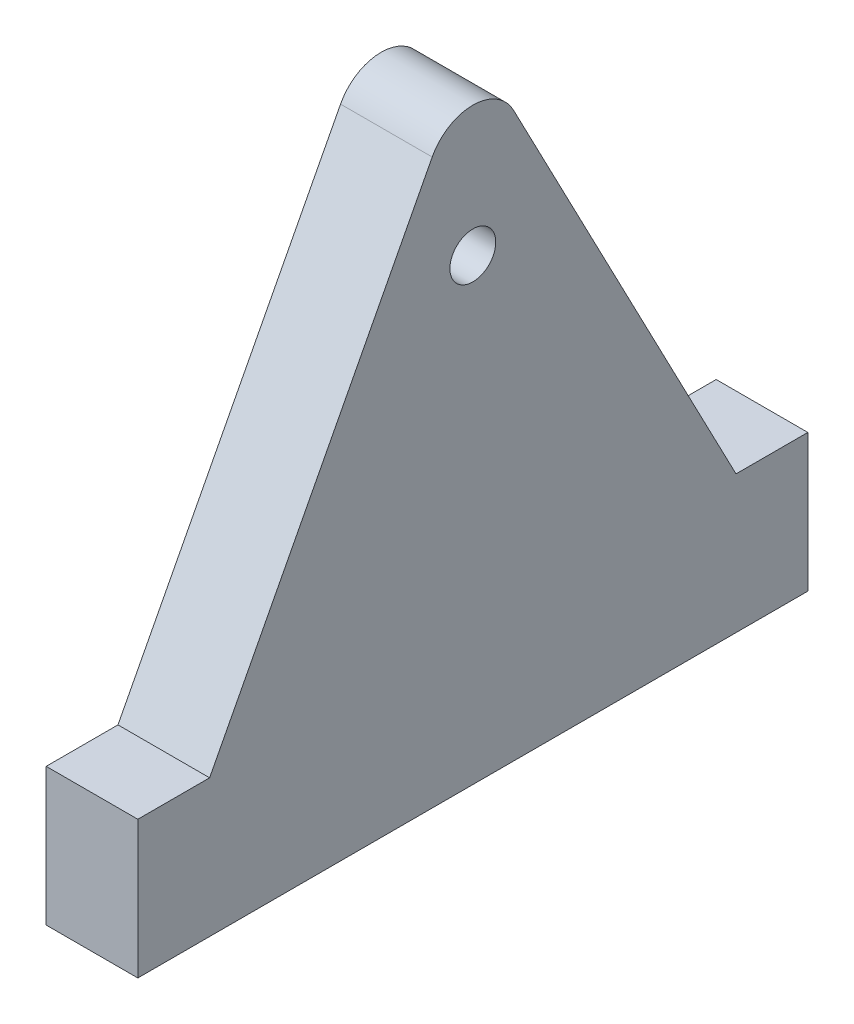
ISO-10303-21;
HEADER;
FILE_DESCRIPTION(('STEP AP214'),'2;1');
FILE_NAME('part.step','',(''),(''),'','','');
FILE_SCHEMA(('AUTOMOTIVE_DESIGN { 1 0 10303 214 1 1 1 1 }'));
ENDSEC;
DATA;
#1=APPLICATION_CONTEXT('core data for automotive mechanical design processes');
#2=APPLICATION_PROTOCOL_DEFINITION('international standard','automotive_design',2000,#1);
#3=PRODUCT_CONTEXT('',#1,'mechanical');
#4=PRODUCT('Part','Part','',(#3));
#5=PRODUCT_RELATED_PRODUCT_CATEGORY('part','',(#4));
#6=PRODUCT_DEFINITION_FORMATION('','',#4);
#7=PRODUCT_DEFINITION_CONTEXT('part definition',#1,'design');
#8=PRODUCT_DEFINITION('design','',#6,#7);
#9=PRODUCT_DEFINITION_SHAPE('','',#8);
#10=(LENGTH_UNIT() NAMED_UNIT(*) SI_UNIT(.MILLI.,.METRE.));
#11=(NAMED_UNIT(*) PLANE_ANGLE_UNIT() SI_UNIT($,.RADIAN.));
#12=(NAMED_UNIT(*) SI_UNIT($,.STERADIAN.) SOLID_ANGLE_UNIT());
#13=UNCERTAINTY_MEASURE_WITH_UNIT(LENGTH_MEASURE(1.E-05),#10,'distance_accuracy_value','');
#14=(GEOMETRIC_REPRESENTATION_CONTEXT(3) GLOBAL_UNCERTAINTY_ASSIGNED_CONTEXT((#13)) GLOBAL_UNIT_ASSIGNED_CONTEXT((#10,
#11,#12)) REPRESENTATION_CONTEXT('',''));
#15=CARTESIAN_POINT('',(0.,0.,0.));
#16=DIRECTION('',(0.,0.,1.));
#17=DIRECTION('',(1.,0.,0.));
#18=AXIS2_PLACEMENT_3D('',#15,#16,#17);
#19=CARTESIAN_POINT('',(20.,53.0229705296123,8.86438992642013));
#20=DIRECTION('',(0.,-0.462845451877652,-0.886438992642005));
#21=DIRECTION('',(0.,0.886438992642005,-0.462845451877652));
#22=AXIS2_PLACEMENT_3D('',#19,#20,#21);
#23=PLANE('',#22);
#24=DIRECTION('',(-1.,0.,0.));
#25=VECTOR('',#24,1.);
#26=CARTESIAN_POINT('',(20.,-40.,57.4354243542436));
#27=LINE('',#26,#25);
#28=CARTESIAN_POINT('',(20.,-40.,57.4354243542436));
#29=VERTEX_POINT('',#28);
#30=CARTESIAN_POINT('',(0.,-40.,57.4354243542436));
#31=VERTEX_POINT('',#30);
#32=EDGE_CURVE('E145',#29,#31,#27,.T.);
#33=ORIENTED_EDGE('',*,*,#32,.F.);
#34=DIRECTION('',(0.,-0.886438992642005,0.462845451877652));
#35=VECTOR('',#34,1.);
#36=CARTESIAN_POINT('',(20.,53.0229705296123,8.86438992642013));
#37=LINE('',#36,#35);
#38=CARTESIAN_POINT('',(20.,53.0229705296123,8.86438992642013));
#39=VERTEX_POINT('',#38);
#40=EDGE_CURVE('E157',#39,#29,#37,.T.);
#41=ORIENTED_EDGE('',*,*,#40,.F.);
#42=DIRECTION('',(-1.,0.,0.));
#43=VECTOR('',#42,1.);
#44=CARTESIAN_POINT('',(20.,53.0229705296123,8.86438992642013));
#45=LINE('',#44,#43);
#46=CARTESIAN_POINT('',(0.,53.0229705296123,8.86438992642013));
#47=VERTEX_POINT('',#46);
#48=EDGE_CURVE('E11',#39,#47,#45,.T.);
#49=ORIENTED_EDGE('',*,*,#48,.T.);
#50=DIRECTION('',(0.,-0.886438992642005,0.462845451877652));
#51=VECTOR('',#50,1.);
#52=CARTESIAN_POINT('',(0.,53.0229705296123,8.86438992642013));
#53=LINE('',#52,#51);
#54=EDGE_CURVE('E166',#47,#31,#53,.T.);
#55=ORIENTED_EDGE('',*,*,#54,.T.);
#56=EDGE_LOOP('',(#33,#41,#49,#55));
#57=FACE_BOUND('',#56,.T.);
#58=ADVANCED_FACE('F41',(#57),#23,.F.);
#59=CARTESIAN_POINT('',(20.,53.0229705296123,-8.86438992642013));
#60=DIRECTION('',(0.,0.462845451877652,-0.886438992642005));
#61=DIRECTION('',(0.,0.886438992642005,0.462845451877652));
#62=AXIS2_PLACEMENT_3D('',#59,#60,#61);
#63=PLANE('',#62);
#64=DIRECTION('',(0.,-0.886438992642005,-0.462845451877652));
#65=VECTOR('',#64,1.);
#66=CARTESIAN_POINT('',(20.,53.0229705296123,-8.86438992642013));
#67=LINE('',#66,#65);
#68=CARTESIAN_POINT('',(20.,53.0229705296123,-8.86438992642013));
#69=VERTEX_POINT('',#68);
#70=CARTESIAN_POINT('',(20.,-40.,-57.4354243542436));
#71=VERTEX_POINT('',#70);
#72=EDGE_CURVE('E56',#69,#71,#67,.T.);
#73=ORIENTED_EDGE('',*,*,#72,.T.);
#74=DIRECTION('',(-1.,0.,0.));
#75=VECTOR('',#74,1.);
#76=CARTESIAN_POINT('',(20.,-40.,-57.4354243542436));
#77=LINE('',#76,#75);
#78=CARTESIAN_POINT('',(0.,-40.,-57.4354243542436));
#79=VERTEX_POINT('',#78);
#80=EDGE_CURVE('E60',#71,#79,#77,.T.);
#81=ORIENTED_EDGE('',*,*,#80,.T.);
#82=DIRECTION('',(0.,-0.886438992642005,-0.462845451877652));
#83=VECTOR('',#82,1.);
#84=CARTESIAN_POINT('',(0.,53.0229705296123,-8.86438992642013));
#85=LINE('',#84,#83);
#86=CARTESIAN_POINT('',(0.,53.0229705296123,-8.86438992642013));
#87=VERTEX_POINT('',#86);
#88=EDGE_CURVE('E113',#87,#79,#85,.T.);
#89=ORIENTED_EDGE('',*,*,#88,.F.);
#90=DIRECTION('',(-1.,0.,0.));
#91=VECTOR('',#90,1.);
#92=CARTESIAN_POINT('',(20.,53.0229705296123,-8.86438992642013));
#93=LINE('',#92,#91);
#94=EDGE_CURVE('E163',#69,#87,#93,.T.);
#95=ORIENTED_EDGE('',*,*,#94,.F.);
#96=EDGE_LOOP('',(#73,#81,#89,#95));
#97=FACE_BOUND('',#96,.T.);
#98=ADVANCED_FACE('F192',(#97),#63,.T.);
#99=CARTESIAN_POINT('',(20.,48.394516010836,0.));
#100=DIRECTION('',(-1.,0.,0.));
#101=DIRECTION('',(0.,0.,1.));
#102=AXIS2_PLACEMENT_3D('',#99,#100,#101);
#103=CYLINDRICAL_SURFACE('',#102,10.);
#104=CARTESIAN_POINT('',(0.,48.394516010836,0.));
#105=DIRECTION('',(1.,0.,0.));
#106=DIRECTION('',(0.,0.,-1.));
#107=AXIS2_PLACEMENT_3D('',#104,#105,#106);
#108=CIRCLE('',#107,10.);
#109=EDGE_CURVE('E153',#87,#47,#108,.T.);
#110=ORIENTED_EDGE('',*,*,#109,.T.);
#111=ORIENTED_EDGE('',*,*,#48,.F.);
#112=CARTESIAN_POINT('',(20.,48.394516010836,0.));
#113=DIRECTION('',(1.,0.,0.));
#114=DIRECTION('',(0.,0.,-1.));
#115=AXIS2_PLACEMENT_3D('',#112,#113,#114);
#116=CIRCLE('',#115,10.);
#117=EDGE_CURVE('E154',#69,#39,#116,.T.);
#118=ORIENTED_EDGE('',*,*,#117,.F.);
#119=ORIENTED_EDGE('',*,*,#94,.T.);
#120=EDGE_LOOP('',(#110,#111,#118,#119));
#121=FACE_BOUND('',#120,.T.);
#122=ADVANCED_FACE('F43',(#121),#103,.T.);
#123=CARTESIAN_POINT('',(20.,-70.,73.09963099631));
#124=DIRECTION('',(0.,1.,0.));
#125=DIRECTION('',(0.,0.,1.));
#126=AXIS2_PLACEMENT_3D('',#123,#124,#125);
#127=PLANE('',#126);
#128=DIRECTION('',(0.,0.,-1.));
#129=VECTOR('',#128,1.);
#130=CARTESIAN_POINT('',(0.,-70.,73.09963099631));
#131=LINE('',#130,#129);
#132=CARTESIAN_POINT('',(0.,-70.,73.09963099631));
#133=VERTEX_POINT('',#132);
#134=CARTESIAN_POINT('',(0.,-70.,-73.09963099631));
#135=VERTEX_POINT('',#134);
#136=EDGE_CURVE('E169',#133,#135,#131,.T.);
#137=ORIENTED_EDGE('',*,*,#136,.T.);
#138=DIRECTION('',(-1.,0.,0.));
#139=VECTOR('',#138,1.);
#140=CARTESIAN_POINT('',(20.,-70.,-73.09963099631));
#141=LINE('',#140,#139);
#142=CARTESIAN_POINT('',(20.,-70.,-73.09963099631));
#143=VERTEX_POINT('',#142);
#144=EDGE_CURVE('E124',#143,#135,#141,.T.);
#145=ORIENTED_EDGE('',*,*,#144,.F.);
#146=DIRECTION('',(0.,0.,-1.));
#147=VECTOR('',#146,1.);
#148=CARTESIAN_POINT('',(20.,-70.,73.09963099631));
#149=LINE('',#148,#147);
#150=CARTESIAN_POINT('',(20.,-70.,73.09963099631));
#151=VERTEX_POINT('',#150);
#152=EDGE_CURVE('E160',#151,#143,#149,.T.);
#153=ORIENTED_EDGE('',*,*,#152,.F.);
#154=DIRECTION('',(-1.,0.,0.));
#155=VECTOR('',#154,1.);
#156=CARTESIAN_POINT('',(20.,-70.,73.09963099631));
#157=LINE('',#156,#155);
#158=EDGE_CURVE('E49',#151,#133,#157,.T.);
#159=ORIENTED_EDGE('',*,*,#158,.T.);
#160=EDGE_LOOP('',(#137,#145,#153,#159));
#161=FACE_BOUND('',#160,.T.);
#162=ADVANCED_FACE('F177',(#161),#127,.F.);
#163=CARTESIAN_POINT('',(20.,48.394516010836,0.));
#164=DIRECTION('',(1.,0.,0.));
#165=DIRECTION('',(0.,0.,-1.));
#166=AXIS2_PLACEMENT_3D('',#163,#164,#165);
#167=PLANE('',#166);
#168=ORIENTED_EDGE('',*,*,#152,.T.);
#169=DIRECTION('',(0.,-1.,0.));
#170=VECTOR('',#169,1.);
#171=CARTESIAN_POINT('',(20.,-40.,-73.09963099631));
#172=LINE('',#171,#170);
#173=CARTESIAN_POINT('',(20.,-40.,-73.09963099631));
#174=VERTEX_POINT('',#173);
#175=EDGE_CURVE('E125',#174,#143,#172,.T.);
#176=ORIENTED_EDGE('',*,*,#175,.F.);
#177=DIRECTION('',(0.,0.,1.));
#178=VECTOR('',#177,1.);
#179=CARTESIAN_POINT('',(20.,-40.,73.09963099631));
#180=LINE('',#179,#178);
#181=EDGE_CURVE('E131',#174,#71,#180,.T.);
#182=ORIENTED_EDGE('',*,*,#181,.T.);
#183=ORIENTED_EDGE('',*,*,#72,.F.);
#184=ORIENTED_EDGE('',*,*,#117,.T.);
#185=ORIENTED_EDGE('',*,*,#40,.T.);
#186=CARTESIAN_POINT('',(20.,-40.,73.09963099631));
#187=VERTEX_POINT('',#186);
#188=EDGE_CURVE('E132',#29,#187,#180,.T.);
#189=ORIENTED_EDGE('',*,*,#188,.T.);
#190=DIRECTION('',(0.,-1.,0.));
#191=VECTOR('',#190,1.);
#192=CARTESIAN_POINT('',(20.,-40.,73.09963099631));
#193=LINE('',#192,#191);
#194=EDGE_CURVE('E141',#187,#151,#193,.T.);
#195=ORIENTED_EDGE('',*,*,#194,.T.);
#196=EDGE_LOOP('',(#168,#176,#182,#183,#184,#185,#189,#195));
#197=FACE_BOUND('',#196,.T.);
#198=CARTESIAN_POINT('',(20.,30.,0.));
#199=DIRECTION('',(1.,0.,0.));
#200=DIRECTION('',(0.,0.,-1.));
#201=AXIS2_PLACEMENT_3D('',#198,#199,#200);
#202=CIRCLE('',#201,5.);
#203=CARTESIAN_POINT('',(20.,30.,-5.));
#204=VERTEX_POINT('',#203);
#205=EDGE_CURVE('E150',#204,#204,#202,.T.);
#206=ORIENTED_EDGE('',*,*,#205,.F.);
#207=EDGE_LOOP('',(#206));
#208=FACE_BOUND('',#207,.T.);
#209=ADVANCED_FACE('F187',(#197,#208),#167,.T.);
#210=CARTESIAN_POINT('',(0.,48.394516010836,0.));
#211=DIRECTION('',(1.,0.,0.));
#212=DIRECTION('',(0.,0.,-1.));
#213=AXIS2_PLACEMENT_3D('',#210,#211,#212);
#214=PLANE('',#213);
#215=ORIENTED_EDGE('',*,*,#136,.F.);
#216=DIRECTION('',(0.,-1.,0.));
#217=VECTOR('',#216,1.);
#218=CARTESIAN_POINT('',(0.,-40.,73.09963099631));
#219=LINE('',#218,#217);
#220=CARTESIAN_POINT('',(0.,-40.,73.09963099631));
#221=VERTEX_POINT('',#220);
#222=EDGE_CURVE('E139',#221,#133,#219,.T.);
#223=ORIENTED_EDGE('',*,*,#222,.F.);
#224=DIRECTION('',(0.,0.,-1.));
#225=VECTOR('',#224,1.);
#226=CARTESIAN_POINT('',(0.,-40.,73.09963099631));
#227=LINE('',#226,#225);
#228=EDGE_CURVE('E116',#221,#31,#227,.T.);
#229=ORIENTED_EDGE('',*,*,#228,.T.);
#230=ORIENTED_EDGE('',*,*,#54,.F.);
#231=ORIENTED_EDGE('',*,*,#109,.F.);
#232=ORIENTED_EDGE('',*,*,#88,.T.);
#233=CARTESIAN_POINT('',(0.,-40.,-73.09963099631));
#234=VERTEX_POINT('',#233);
#235=EDGE_CURVE('E105',#79,#234,#227,.T.);
#236=ORIENTED_EDGE('',*,*,#235,.T.);
#237=DIRECTION('',(0.,-1.,0.));
#238=VECTOR('',#237,1.);
#239=CARTESIAN_POINT('',(0.,-40.,-73.09963099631));
#240=LINE('',#239,#238);
#241=EDGE_CURVE('E110',#234,#135,#240,.T.);
#242=ORIENTED_EDGE('',*,*,#241,.T.);
#243=EDGE_LOOP('',(#215,#223,#229,#230,#231,#232,#236,#242));
#244=FACE_BOUND('',#243,.T.);
#245=CARTESIAN_POINT('',(0.,30.,0.));
#246=DIRECTION('',(1.,0.,0.));
#247=DIRECTION('',(0.,0.,-1.));
#248=AXIS2_PLACEMENT_3D('',#245,#246,#247);
#249=CIRCLE('',#248,5.);
#250=CARTESIAN_POINT('',(0.,30.,-5.));
#251=VERTEX_POINT('',#250);
#252=EDGE_CURVE('E147',#251,#251,#249,.T.);
#253=ORIENTED_EDGE('',*,*,#252,.T.);
#254=EDGE_LOOP('',(#253));
#255=FACE_BOUND('',#254,.T.);
#256=ADVANCED_FACE('F108',(#244,#255),#214,.F.);
#257=CARTESIAN_POINT('',(0.,30.,0.));
#258=DIRECTION('',(1.,0.,0.));
#259=DIRECTION('',(0.,0.,-1.));
#260=AXIS2_PLACEMENT_3D('',#257,#258,#259);
#261=CYLINDRICAL_SURFACE('',#260,5.);
#262=ORIENTED_EDGE('',*,*,#205,.T.);
#263=EDGE_LOOP('',(#262));
#264=FACE_BOUND('',#263,.T.);
#265=ORIENTED_EDGE('',*,*,#252,.F.);
#266=EDGE_LOOP('',(#265));
#267=FACE_BOUND('',#266,.T.);
#268=ADVANCED_FACE('F208',(#264,#267),#261,.F.);
#269=CARTESIAN_POINT('',(0.,-40.,-73.09963099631));
#270=DIRECTION('',(0.,0.,-1.));
#271=DIRECTION('',(-1.,0.,0.));
#272=AXIS2_PLACEMENT_3D('',#269,#270,#271);
#273=PLANE('',#272);
#274=ORIENTED_EDGE('',*,*,#144,.T.);
#275=ORIENTED_EDGE('',*,*,#241,.F.);
#276=DIRECTION('',(1.,0.,0.));
#277=VECTOR('',#276,1.);
#278=CARTESIAN_POINT('',(0.,-40.,-73.09963099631));
#279=LINE('',#278,#277);
#280=EDGE_CURVE('E122',#234,#174,#279,.T.);
#281=ORIENTED_EDGE('',*,*,#280,.T.);
#282=ORIENTED_EDGE('',*,*,#175,.T.);
#283=EDGE_LOOP('',(#274,#275,#281,#282));
#284=FACE_BOUND('',#283,.T.);
#285=ADVANCED_FACE('F120',(#284),#273,.T.);
#286=CARTESIAN_POINT('',(0.,-40.,0.));
#287=DIRECTION('',(0.,-1.,0.));
#288=DIRECTION('',(0.,0.,-1.));
#289=AXIS2_PLACEMENT_3D('',#286,#287,#288);
#290=PLANE('',#289);
#291=ORIENTED_EDGE('',*,*,#80,.F.);
#292=ORIENTED_EDGE('',*,*,#181,.F.);
#293=ORIENTED_EDGE('',*,*,#280,.F.);
#294=ORIENTED_EDGE('',*,*,#235,.F.);
#295=EDGE_LOOP('',(#291,#292,#293,#294));
#296=FACE_BOUND('',#295,.T.);
#297=ADVANCED_FACE('F129',(#296),#290,.F.);
#298=ORIENTED_EDGE('',*,*,#188,.F.);
#299=ORIENTED_EDGE('',*,*,#32,.T.);
#300=ORIENTED_EDGE('',*,*,#228,.F.);
#301=DIRECTION('',(-1.,0.,0.));
#302=VECTOR('',#301,1.);
#303=CARTESIAN_POINT('',(0.,-40.,73.09963099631));
#304=LINE('',#303,#302);
#305=EDGE_CURVE('E126',#187,#221,#304,.T.);
#306=ORIENTED_EDGE('',*,*,#305,.F.);
#307=EDGE_LOOP('',(#298,#299,#300,#306));
#308=FACE_BOUND('',#307,.T.);
#309=ADVANCED_FACE('F183',(#308),#290,.F.);
#310=CARTESIAN_POINT('',(0.,-40.,73.09963099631));
#311=DIRECTION('',(0.,0.,1.));
#312=DIRECTION('',(1.,0.,0.));
#313=AXIS2_PLACEMENT_3D('',#310,#311,#312);
#314=PLANE('',#313);
#315=ORIENTED_EDGE('',*,*,#158,.F.);
#316=ORIENTED_EDGE('',*,*,#194,.F.);
#317=ORIENTED_EDGE('',*,*,#305,.T.);
#318=ORIENTED_EDGE('',*,*,#222,.T.);
#319=EDGE_LOOP('',(#315,#316,#317,#318));
#320=FACE_BOUND('',#319,.T.);
#321=ADVANCED_FACE('F185',(#320),#314,.T.);
#322=CLOSED_SHELL('',(#58,#98,#122,#162,#209,#256,#268,#285,#297,#309,#321));
#323=MANIFOLD_SOLID_BREP('B2',#322);
#324=ADVANCED_BREP_SHAPE_REPRESENTATION('',(#18,#323),#14);
#325=SHAPE_DEFINITION_REPRESENTATION(#9,#324);
ENDSEC;
END-ISO-10303-21;
